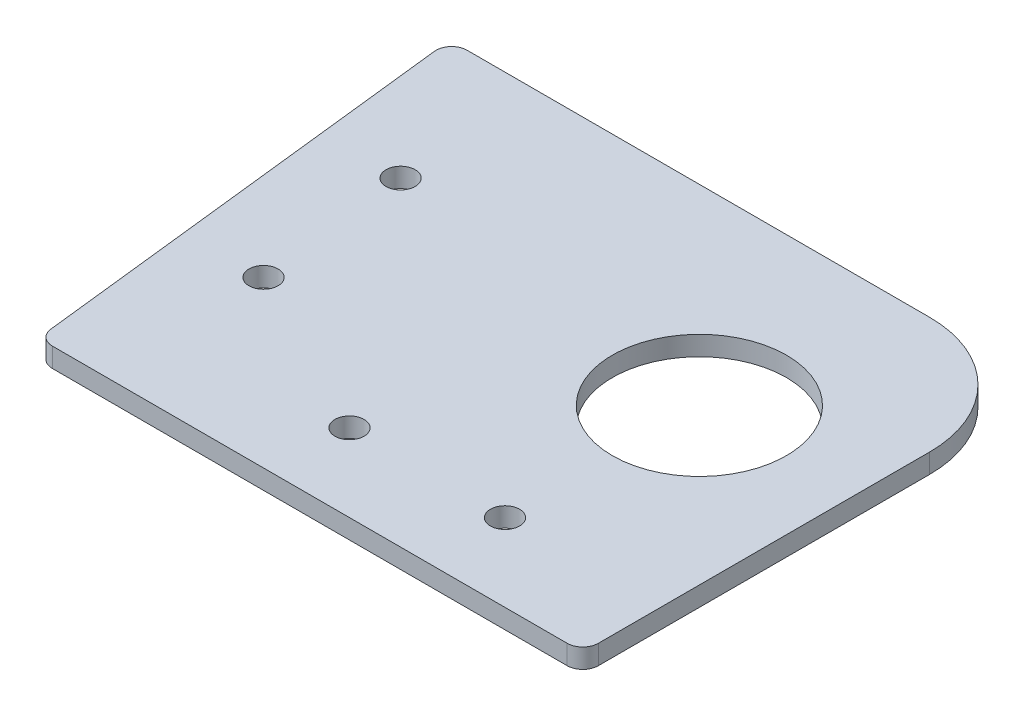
ISO-10303-21;
HEADER;
FILE_DESCRIPTION(('STEP AP214'),'2;1');
FILE_NAME('part.step','',(''),(''),'','','');
FILE_SCHEMA(('AUTOMOTIVE_DESIGN { 1 0 10303 214 1 1 1 1 }'));
ENDSEC;
DATA;
#1=APPLICATION_CONTEXT('core data for automotive mechanical design processes');
#2=APPLICATION_PROTOCOL_DEFINITION('international standard','automotive_design',2000,#1);
#3=PRODUCT_CONTEXT('',#1,'mechanical');
#4=PRODUCT('Part','Part','',(#3));
#5=PRODUCT_RELATED_PRODUCT_CATEGORY('part','',(#4));
#6=PRODUCT_DEFINITION_FORMATION('','',#4);
#7=PRODUCT_DEFINITION_CONTEXT('part definition',#1,'design');
#8=PRODUCT_DEFINITION('design','',#6,#7);
#9=PRODUCT_DEFINITION_SHAPE('','',#8);
#10=(LENGTH_UNIT() NAMED_UNIT(*) SI_UNIT(.MILLI.,.METRE.));
#11=(NAMED_UNIT(*) PLANE_ANGLE_UNIT() SI_UNIT($,.RADIAN.));
#12=(NAMED_UNIT(*) SI_UNIT($,.STERADIAN.) SOLID_ANGLE_UNIT());
#13=UNCERTAINTY_MEASURE_WITH_UNIT(LENGTH_MEASURE(1.E-05),#10,'distance_accuracy_value','');
#14=(GEOMETRIC_REPRESENTATION_CONTEXT(3) GLOBAL_UNCERTAINTY_ASSIGNED_CONTEXT((#13)) GLOBAL_UNIT_ASSIGNED_CONTEXT((#10,
#11,#12)) REPRESENTATION_CONTEXT('',''));
#15=CARTESIAN_POINT('',(0.,0.,0.));
#16=DIRECTION('',(0.,0.,1.));
#17=DIRECTION('',(1.,0.,0.));
#18=AXIS2_PLACEMENT_3D('',#15,#16,#17);
#19=CARTESIAN_POINT('',(0.,3.175,0.));
#20=DIRECTION('',(0.,-1.,0.));
#21=DIRECTION('',(0.,0.,-1.));
#22=AXIS2_PLACEMENT_3D('',#19,#20,#21);
#23=PLANE('',#22);
#24=CARTESIAN_POINT('',(15.4895049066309,3.175,23.519027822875));
#25=DIRECTION('',(0.,1.,0.));
#26=DIRECTION('',(0.,0.,1.));
#27=AXIS2_PLACEMENT_3D('',#24,#25,#26);
#28=CIRCLE('',#27,2.38125000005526);
#29=CARTESIAN_POINT('',(15.4895049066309,3.175,25.9002778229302));
#30=VERTEX_POINT('',#29);
#31=EDGE_CURVE('E197',#30,#30,#28,.T.);
#32=ORIENTED_EDGE('',*,*,#31,.F.);
#33=EDGE_LOOP('',(#32));
#34=FACE_BOUND('',#33,.T.);
#35=CARTESIAN_POINT('',(18.3391419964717,3.175,48.7586706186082));
#36=DIRECTION('',(0.,1.,0.));
#37=DIRECTION('',(0.,0.,1.));
#38=AXIS2_PLACEMENT_3D('',#35,#36,#37);
#39=CIRCLE('',#38,2.38125000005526);
#40=CARTESIAN_POINT('',(18.3391419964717,3.175,51.1399206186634));
#41=VERTEX_POINT('',#40);
#42=EDGE_CURVE('E191',#41,#41,#39,.T.);
#43=ORIENTED_EDGE('',*,*,#42,.F.);
#44=EDGE_LOOP('',(#43));
#45=FACE_BOUND('',#44,.T.);
#46=CARTESIAN_POINT('',(72.0467966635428,3.175,63.0191671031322));
#47=DIRECTION('',(0.,1.,0.));
#48=DIRECTION('',(0.,0.,1.));
#49=AXIS2_PLACEMENT_3D('',#46,#47,#48);
#50=CIRCLE('',#49,2.38125);
#51=CARTESIAN_POINT('',(72.0467966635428,3.175,65.4004171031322));
#52=VERTEX_POINT('',#51);
#53=EDGE_CURVE('E185',#52,#52,#50,.T.);
#54=ORIENTED_EDGE('',*,*,#53,.F.);
#55=EDGE_LOOP('',(#54));
#56=FACE_BOUND('',#55,.T.);
#57=CARTESIAN_POINT('',(46.6467966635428,3.175,63.0191671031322));
#58=DIRECTION('',(0.,1.,0.));
#59=DIRECTION('',(0.,0.,1.));
#60=AXIS2_PLACEMENT_3D('',#57,#58,#59);
#61=CIRCLE('',#60,2.38125);
#62=CARTESIAN_POINT('',(46.6467966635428,3.175,65.4004171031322));
#63=VERTEX_POINT('',#62);
#64=EDGE_CURVE('E179',#63,#63,#61,.T.);
#65=ORIENTED_EDGE('',*,*,#64,.F.);
#66=EDGE_LOOP('',(#65));
#67=FACE_BOUND('',#66,.T.);
#68=DIRECTION('',(0.,0.,-1.));
#69=VECTOR('',#68,1.);
#70=CARTESIAN_POINT('',(97.4467966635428,3.175,0.));
#71=LINE('',#70,#69);
#72=CARTESIAN_POINT('',(97.4467966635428,3.175,73.1791671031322));
#73=VERTEX_POINT('',#72);
#74=CARTESIAN_POINT('',(97.4467966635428,3.175,19.05));
#75=VERTEX_POINT('',#74);
#76=EDGE_CURVE('E135',#73,#75,#71,.T.);
#77=ORIENTED_EDGE('',*,*,#76,.T.);
#78=CARTESIAN_POINT('',(78.3967966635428,3.175,19.05));
#79=DIRECTION('',(0.,-1.,0.));
#80=DIRECTION('',(0.,0.,-1.));
#81=AXIS2_PLACEMENT_3D('',#78,#79,#80);
#82=CIRCLE('',#81,19.05);
#83=CARTESIAN_POINT('',(78.3967966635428,3.175,0.));
#84=VERTEX_POINT('',#83);
#85=EDGE_CURVE('E11',#75,#84,#82,.F.);
#86=ORIENTED_EDGE('',*,*,#85,.T.);
#87=DIRECTION('',(-1.,0.,0.));
#88=VECTOR('',#87,1.);
#89=CARTESIAN_POINT('',(0.,3.175,0.));
#90=LINE('',#89,#88);
#91=CARTESIAN_POINT('',(2.84283189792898,3.175,0.));
#92=VERTEX_POINT('',#91);
#93=EDGE_CURVE('E134',#84,#92,#90,.T.);
#94=ORIENTED_EDGE('',*,*,#93,.T.);
#95=CARTESIAN_POINT('',(2.84283189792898,3.175,2.54));
#96=DIRECTION('',(0.,-1.,0.));
#97=DIRECTION('',(0.,0.,-1.));
#98=AXIS2_PLACEMENT_3D('',#95,#96,#97);
#99=CIRCLE('',#98,2.54);
#100=CARTESIAN_POINT('',(0.318859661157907,3.175,2.82489322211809));
#101=VERTEX_POINT('',#100);
#102=EDGE_CURVE('E144',#92,#101,#99,.F.);
#103=ORIENTED_EDGE('',*,*,#102,.T.);
#104=DIRECTION('',(0.112162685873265,0.,0.993689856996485));
#105=VECTOR('',#104,1.);
#106=CARTESIAN_POINT('',(0.,3.175,0.));
#107=LINE('',#106,#105);
#108=CARTESIAN_POINT('',(8.29225161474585,3.175,73.4640603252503));
#109=VERTEX_POINT('',#108);
#110=EDGE_CURVE('E116',#101,#109,#107,.T.);
#111=ORIENTED_EDGE('',*,*,#110,.T.);
#112=CARTESIAN_POINT('',(10.8162238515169,3.175,73.1791671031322));
#113=DIRECTION('',(0.,-1.,0.));
#114=DIRECTION('',(0.,0.,-1.));
#115=AXIS2_PLACEMENT_3D('',#112,#113,#114);
#116=CIRCLE('',#115,2.54);
#117=CARTESIAN_POINT('',(10.8162238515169,3.175,75.7191671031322));
#118=VERTEX_POINT('',#117);
#119=EDGE_CURVE('E140',#109,#118,#116,.F.);
#120=ORIENTED_EDGE('',*,*,#119,.T.);
#121=DIRECTION('',(1.,0.,0.));
#122=VECTOR('',#121,1.);
#123=CARTESIAN_POINT('',(8.54679666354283,3.175,75.7191671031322));
#124=LINE('',#123,#122);
#125=CARTESIAN_POINT('',(94.9067966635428,3.175,75.7191671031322));
#126=VERTEX_POINT('',#125);
#127=EDGE_CURVE('E168',#118,#126,#124,.T.);
#128=ORIENTED_EDGE('',*,*,#127,.T.);
#129=CARTESIAN_POINT('',(94.9067966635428,3.175,73.1791671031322));
#130=DIRECTION('',(0.,-1.,0.));
#131=DIRECTION('',(0.,0.,-1.));
#132=AXIS2_PLACEMENT_3D('',#129,#130,#131);
#133=CIRCLE('',#132,2.54);
#134=EDGE_CURVE('E142',#126,#73,#133,.F.);
#135=ORIENTED_EDGE('',*,*,#134,.T.);
#136=EDGE_LOOP('',(#77,#86,#94,#103,#111,#120,#128,#135));
#137=FACE_BOUND('',#136,.T.);
#138=CARTESIAN_POINT('',(72.0467966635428,3.175,31.2691671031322));
#139=DIRECTION('',(0.,1.,0.));
#140=DIRECTION('',(0.,0.,1.));
#141=AXIS2_PLACEMENT_3D('',#138,#139,#140);
#142=CIRCLE('',#141,14.224);
#143=CARTESIAN_POINT('',(72.0467966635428,3.175,45.4931671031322));
#144=VERTEX_POINT('',#143);
#145=EDGE_CURVE('E129',#144,#144,#142,.T.);
#146=ORIENTED_EDGE('',*,*,#145,.F.);
#147=EDGE_LOOP('',(#146));
#148=FACE_BOUND('',#147,.T.);
#149=ADVANCED_FACE('F33',(#34,#45,#56,#67,#137,#148),#23,.F.);
#150=CARTESIAN_POINT('',(0.,0.,0.));
#151=DIRECTION('',(0.,-1.,0.));
#152=DIRECTION('',(0.,0.,-1.));
#153=AXIS2_PLACEMENT_3D('',#150,#151,#152);
#154=PLANE('',#153);
#155=CARTESIAN_POINT('',(15.4895049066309,0.,23.519027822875));
#156=DIRECTION('',(0.,1.,0.));
#157=DIRECTION('',(0.,0.,1.));
#158=AXIS2_PLACEMENT_3D('',#155,#156,#157);
#159=CIRCLE('',#158,2.38125000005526);
#160=CARTESIAN_POINT('',(15.4895049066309,0.,25.9002778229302));
#161=VERTEX_POINT('',#160);
#162=EDGE_CURVE('E194',#161,#161,#159,.T.);
#163=ORIENTED_EDGE('',*,*,#162,.T.);
#164=EDGE_LOOP('',(#163));
#165=FACE_BOUND('',#164,.T.);
#166=CARTESIAN_POINT('',(18.3391419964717,0.,48.7586706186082));
#167=DIRECTION('',(0.,1.,0.));
#168=DIRECTION('',(0.,0.,1.));
#169=AXIS2_PLACEMENT_3D('',#166,#167,#168);
#170=CIRCLE('',#169,2.38125000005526);
#171=CARTESIAN_POINT('',(18.3391419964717,0.,51.1399206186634));
#172=VERTEX_POINT('',#171);
#173=EDGE_CURVE('E188',#172,#172,#170,.T.);
#174=ORIENTED_EDGE('',*,*,#173,.T.);
#175=EDGE_LOOP('',(#174));
#176=FACE_BOUND('',#175,.T.);
#177=CARTESIAN_POINT('',(72.0467966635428,0.,63.0191671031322));
#178=DIRECTION('',(0.,1.,0.));
#179=DIRECTION('',(0.,0.,1.));
#180=AXIS2_PLACEMENT_3D('',#177,#178,#179);
#181=CIRCLE('',#180,2.38125);
#182=CARTESIAN_POINT('',(72.0467966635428,0.,65.4004171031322));
#183=VERTEX_POINT('',#182);
#184=EDGE_CURVE('E182',#183,#183,#181,.T.);
#185=ORIENTED_EDGE('',*,*,#184,.T.);
#186=EDGE_LOOP('',(#185));
#187=FACE_BOUND('',#186,.T.);
#188=CARTESIAN_POINT('',(46.6467966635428,0.,63.0191671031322));
#189=DIRECTION('',(0.,1.,0.));
#190=DIRECTION('',(0.,0.,1.));
#191=AXIS2_PLACEMENT_3D('',#188,#189,#190);
#192=CIRCLE('',#191,2.38125);
#193=CARTESIAN_POINT('',(46.6467966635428,0.,65.4004171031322));
#194=VERTEX_POINT('',#193);
#195=EDGE_CURVE('E176',#194,#194,#192,.T.);
#196=ORIENTED_EDGE('',*,*,#195,.T.);
#197=EDGE_LOOP('',(#196));
#198=FACE_BOUND('',#197,.T.);
#199=DIRECTION('',(-1.,0.,0.));
#200=VECTOR('',#199,1.);
#201=CARTESIAN_POINT('',(0.,0.,0.));
#202=LINE('',#201,#200);
#203=CARTESIAN_POINT('',(78.3967966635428,0.,0.));
#204=VERTEX_POINT('',#203);
#205=CARTESIAN_POINT('',(2.84283189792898,0.,0.));
#206=VERTEX_POINT('',#205);
#207=EDGE_CURVE('E124',#204,#206,#202,.T.);
#208=ORIENTED_EDGE('',*,*,#207,.F.);
#209=CARTESIAN_POINT('',(78.3967966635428,0.,19.05));
#210=DIRECTION('',(0.,-1.,0.));
#211=DIRECTION('',(0.,0.,-1.));
#212=AXIS2_PLACEMENT_3D('',#209,#210,#211);
#213=CIRCLE('',#212,19.05);
#214=CARTESIAN_POINT('',(97.4467966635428,0.,19.05));
#215=VERTEX_POINT('',#214);
#216=EDGE_CURVE('E55',#204,#215,#213,.T.);
#217=ORIENTED_EDGE('',*,*,#216,.T.);
#218=DIRECTION('',(0.,0.,-1.));
#219=VECTOR('',#218,1.);
#220=CARTESIAN_POINT('',(97.4467966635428,0.,0.));
#221=LINE('',#220,#219);
#222=CARTESIAN_POINT('',(97.4467966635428,0.,73.1791671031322));
#223=VERTEX_POINT('',#222);
#224=EDGE_CURVE('E127',#223,#215,#221,.T.);
#225=ORIENTED_EDGE('',*,*,#224,.F.);
#226=CARTESIAN_POINT('',(94.9067966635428,0.,73.1791671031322));
#227=DIRECTION('',(0.,-1.,0.));
#228=DIRECTION('',(0.,0.,-1.));
#229=AXIS2_PLACEMENT_3D('',#226,#227,#228);
#230=CIRCLE('',#229,2.54);
#231=CARTESIAN_POINT('',(94.9067966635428,0.,75.7191671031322));
#232=VERTEX_POINT('',#231);
#233=EDGE_CURVE('E107',#223,#232,#230,.T.);
#234=ORIENTED_EDGE('',*,*,#233,.T.);
#235=DIRECTION('',(1.,0.,0.));
#236=VECTOR('',#235,1.);
#237=CARTESIAN_POINT('',(8.54679666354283,0.,75.7191671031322));
#238=LINE('',#237,#236);
#239=CARTESIAN_POINT('',(10.8162238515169,0.,75.7191671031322));
#240=VERTEX_POINT('',#239);
#241=EDGE_CURVE('E123',#240,#232,#238,.T.);
#242=ORIENTED_EDGE('',*,*,#241,.F.);
#243=CARTESIAN_POINT('',(10.8162238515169,0.,73.1791671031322));
#244=DIRECTION('',(0.,-1.,0.));
#245=DIRECTION('',(0.,0.,-1.));
#246=AXIS2_PLACEMENT_3D('',#243,#244,#245);
#247=CIRCLE('',#246,2.54);
#248=CARTESIAN_POINT('',(8.29225161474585,0.,73.4640603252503));
#249=VERTEX_POINT('',#248);
#250=EDGE_CURVE('E117',#240,#249,#247,.T.);
#251=ORIENTED_EDGE('',*,*,#250,.T.);
#252=DIRECTION('',(0.112162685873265,0.,0.993689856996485));
#253=VECTOR('',#252,1.);
#254=CARTESIAN_POINT('',(0.,0.,0.));
#255=LINE('',#254,#253);
#256=CARTESIAN_POINT('',(0.318859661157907,0.,2.82489322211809));
#257=VERTEX_POINT('',#256);
#258=EDGE_CURVE('E113',#257,#249,#255,.T.);
#259=ORIENTED_EDGE('',*,*,#258,.F.);
#260=CARTESIAN_POINT('',(2.84283189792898,0.,2.54));
#261=DIRECTION('',(0.,-1.,0.));
#262=DIRECTION('',(0.,0.,-1.));
#263=AXIS2_PLACEMENT_3D('',#260,#261,#262);
#264=CIRCLE('',#263,2.54);
#265=EDGE_CURVE('E99',#257,#206,#264,.T.);
#266=ORIENTED_EDGE('',*,*,#265,.T.);
#267=EDGE_LOOP('',(#208,#217,#225,#234,#242,#251,#259,#266));
#268=FACE_BOUND('',#267,.T.);
#269=CARTESIAN_POINT('',(72.0467966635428,0.,31.2691671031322));
#270=DIRECTION('',(0.,1.,0.));
#271=DIRECTION('',(0.,0.,1.));
#272=AXIS2_PLACEMENT_3D('',#269,#270,#271);
#273=CIRCLE('',#272,14.224);
#274=CARTESIAN_POINT('',(72.0467966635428,0.,45.4931671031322));
#275=VERTEX_POINT('',#274);
#276=EDGE_CURVE('E173',#275,#275,#273,.T.);
#277=ORIENTED_EDGE('',*,*,#276,.T.);
#278=EDGE_LOOP('',(#277));
#279=FACE_BOUND('',#278,.T.);
#280=ADVANCED_FACE('F120',(#165,#176,#187,#198,#268,#279),#154,.T.);
#281=CARTESIAN_POINT('',(0.,3.175,0.));
#282=DIRECTION('',(0.,0.,1.));
#283=DIRECTION('',(1.,0.,0.));
#284=AXIS2_PLACEMENT_3D('',#281,#282,#283);
#285=PLANE('',#284);
#286=ORIENTED_EDGE('',*,*,#93,.F.);
#287=DIRECTION('',(0.,-1.,0.));
#288=VECTOR('',#287,1.);
#289=CARTESIAN_POINT('',(78.3967966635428,3.175,0.));
#290=LINE('',#289,#288);
#291=EDGE_CURVE('E154',#84,#204,#290,.T.);
#292=ORIENTED_EDGE('',*,*,#291,.T.);
#293=ORIENTED_EDGE('',*,*,#207,.T.);
#294=DIRECTION('',(0.,-1.,0.));
#295=VECTOR('',#294,1.);
#296=CARTESIAN_POINT('',(2.84283189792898,3.175,0.));
#297=LINE('',#296,#295);
#298=EDGE_CURVE('E105',#206,#92,#297,.F.);
#299=ORIENTED_EDGE('',*,*,#298,.T.);
#300=EDGE_LOOP('',(#286,#292,#293,#299));
#301=FACE_BOUND('',#300,.T.);
#302=ADVANCED_FACE('F160',(#301),#285,.F.);
#303=CARTESIAN_POINT('',(0.,3.175,0.));
#304=DIRECTION('',(0.993689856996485,0.,-0.112162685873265));
#305=DIRECTION('',(-0.112162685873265,0.,-0.993689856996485));
#306=AXIS2_PLACEMENT_3D('',#303,#304,#305);
#307=PLANE('',#306);
#308=ORIENTED_EDGE('',*,*,#110,.F.);
#309=DIRECTION('',(0.,-1.,0.));
#310=VECTOR('',#309,1.);
#311=CARTESIAN_POINT('',(0.318859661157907,3.175,2.82489322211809));
#312=LINE('',#311,#310);
#313=EDGE_CURVE('E103',#101,#257,#312,.T.);
#314=ORIENTED_EDGE('',*,*,#313,.T.);
#315=ORIENTED_EDGE('',*,*,#258,.T.);
#316=DIRECTION('',(0.,-1.,0.));
#317=VECTOR('',#316,1.);
#318=CARTESIAN_POINT('',(8.29225161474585,3.175,73.4640603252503));
#319=LINE('',#318,#317);
#320=EDGE_CURVE('E118',#249,#109,#319,.F.);
#321=ORIENTED_EDGE('',*,*,#320,.T.);
#322=EDGE_LOOP('',(#308,#314,#315,#321));
#323=FACE_BOUND('',#322,.T.);
#324=ADVANCED_FACE('F112',(#323),#307,.F.);
#325=CARTESIAN_POINT('',(8.54679666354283,3.175,75.7191671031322));
#326=DIRECTION('',(0.,0.,-1.));
#327=DIRECTION('',(-1.,0.,0.));
#328=AXIS2_PLACEMENT_3D('',#325,#326,#327);
#329=PLANE('',#328);
#330=ORIENTED_EDGE('',*,*,#241,.T.);
#331=DIRECTION('',(0.,-1.,0.));
#332=VECTOR('',#331,1.);
#333=CARTESIAN_POINT('',(94.9067966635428,3.175,75.7191671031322));
#334=LINE('',#333,#332);
#335=EDGE_CURVE('E152',#232,#126,#334,.F.);
#336=ORIENTED_EDGE('',*,*,#335,.T.);
#337=ORIENTED_EDGE('',*,*,#127,.F.);
#338=DIRECTION('',(0.,-1.,0.));
#339=VECTOR('',#338,1.);
#340=CARTESIAN_POINT('',(10.8162238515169,3.175,75.7191671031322));
#341=LINE('',#340,#339);
#342=EDGE_CURVE('E149',#118,#240,#341,.T.);
#343=ORIENTED_EDGE('',*,*,#342,.T.);
#344=EDGE_LOOP('',(#330,#336,#337,#343));
#345=FACE_BOUND('',#344,.T.);
#346=ADVANCED_FACE('F245',(#345),#329,.F.);
#347=CARTESIAN_POINT('',(97.4467966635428,3.175,0.));
#348=DIRECTION('',(-1.,0.,0.));
#349=DIRECTION('',(0.,0.,1.));
#350=AXIS2_PLACEMENT_3D('',#347,#348,#349);
#351=PLANE('',#350);
#352=ORIENTED_EDGE('',*,*,#224,.T.);
#353=DIRECTION('',(0.,-1.,0.));
#354=VECTOR('',#353,1.);
#355=CARTESIAN_POINT('',(97.4467966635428,3.175,19.05));
#356=LINE('',#355,#354);
#357=EDGE_CURVE('E41',#215,#75,#356,.F.);
#358=ORIENTED_EDGE('',*,*,#357,.T.);
#359=ORIENTED_EDGE('',*,*,#76,.F.);
#360=DIRECTION('',(0.,-1.,0.));
#361=VECTOR('',#360,1.);
#362=CARTESIAN_POINT('',(97.4467966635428,3.175,73.1791671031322));
#363=LINE('',#362,#361);
#364=EDGE_CURVE('E146',#73,#223,#363,.T.);
#365=ORIENTED_EDGE('',*,*,#364,.T.);
#366=EDGE_LOOP('',(#352,#358,#359,#365));
#367=FACE_BOUND('',#366,.T.);
#368=ADVANCED_FACE('F238',(#367),#351,.F.);
#369=CARTESIAN_POINT('',(72.0467966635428,3.175,31.2691671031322));
#370=DIRECTION('',(0.,-1.,0.));
#371=DIRECTION('',(0.,0.,-1.));
#372=AXIS2_PLACEMENT_3D('',#369,#370,#371);
#373=CYLINDRICAL_SURFACE('',#372,14.224);
#374=ORIENTED_EDGE('',*,*,#145,.T.);
#375=EDGE_LOOP('',(#374));
#376=FACE_BOUND('',#375,.T.);
#377=ORIENTED_EDGE('',*,*,#276,.F.);
#378=EDGE_LOOP('',(#377));
#379=FACE_BOUND('',#378,.T.);
#380=ADVANCED_FACE('F236',(#376,#379),#373,.F.);
#381=CARTESIAN_POINT('',(2.84283189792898,3.175,2.54));
#382=DIRECTION('',(0.,-1.,0.));
#383=DIRECTION('',(0.,0.,-1.));
#384=AXIS2_PLACEMENT_3D('',#381,#382,#383);
#385=CYLINDRICAL_SURFACE('',#384,2.54);
#386=ORIENTED_EDGE('',*,*,#102,.F.);
#387=ORIENTED_EDGE('',*,*,#298,.F.);
#388=ORIENTED_EDGE('',*,*,#265,.F.);
#389=ORIENTED_EDGE('',*,*,#313,.F.);
#390=EDGE_LOOP('',(#386,#387,#388,#389));
#391=FACE_BOUND('',#390,.T.);
#392=ADVANCED_FACE('F102',(#391),#385,.T.);
#393=CARTESIAN_POINT('',(94.9067966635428,3.175,73.1791671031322));
#394=DIRECTION('',(0.,-1.,0.));
#395=DIRECTION('',(0.,0.,-1.));
#396=AXIS2_PLACEMENT_3D('',#393,#394,#395);
#397=CYLINDRICAL_SURFACE('',#396,2.54);
#398=ORIENTED_EDGE('',*,*,#134,.F.);
#399=ORIENTED_EDGE('',*,*,#335,.F.);
#400=ORIENTED_EDGE('',*,*,#233,.F.);
#401=ORIENTED_EDGE('',*,*,#364,.F.);
#402=EDGE_LOOP('',(#398,#399,#400,#401));
#403=FACE_BOUND('',#402,.T.);
#404=ADVANCED_FACE('F255',(#403),#397,.T.);
#405=CARTESIAN_POINT('',(10.8162238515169,3.175,73.1791671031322));
#406=DIRECTION('',(0.,-1.,0.));
#407=DIRECTION('',(0.,0.,-1.));
#408=AXIS2_PLACEMENT_3D('',#405,#406,#407);
#409=CYLINDRICAL_SURFACE('',#408,2.54);
#410=ORIENTED_EDGE('',*,*,#119,.F.);
#411=ORIENTED_EDGE('',*,*,#320,.F.);
#412=ORIENTED_EDGE('',*,*,#250,.F.);
#413=ORIENTED_EDGE('',*,*,#342,.F.);
#414=EDGE_LOOP('',(#410,#411,#412,#413));
#415=FACE_BOUND('',#414,.T.);
#416=ADVANCED_FACE('F232',(#415),#409,.T.);
#417=CARTESIAN_POINT('',(78.3967966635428,3.175,19.05));
#418=DIRECTION('',(0.,-1.,0.));
#419=DIRECTION('',(0.,0.,-1.));
#420=AXIS2_PLACEMENT_3D('',#417,#418,#419);
#421=CYLINDRICAL_SURFACE('',#420,19.05);
#422=ORIENTED_EDGE('',*,*,#85,.F.);
#423=ORIENTED_EDGE('',*,*,#357,.F.);
#424=ORIENTED_EDGE('',*,*,#216,.F.);
#425=ORIENTED_EDGE('',*,*,#291,.F.);
#426=EDGE_LOOP('',(#422,#423,#424,#425));
#427=FACE_BOUND('',#426,.T.);
#428=ADVANCED_FACE('F35',(#427),#421,.T.);
#429=CARTESIAN_POINT('',(46.6467966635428,0.,63.0191671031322));
#430=DIRECTION('',(0.,1.,0.));
#431=DIRECTION('',(0.,0.,1.));
#432=AXIS2_PLACEMENT_3D('',#429,#430,#431);
#433=CYLINDRICAL_SURFACE('',#432,2.38125);
#434=ORIENTED_EDGE('',*,*,#195,.F.);
#435=EDGE_LOOP('',(#434));
#436=FACE_BOUND('',#435,.T.);
#437=ORIENTED_EDGE('',*,*,#64,.T.);
#438=EDGE_LOOP('',(#437));
#439=FACE_BOUND('',#438,.T.);
#440=ADVANCED_FACE('F221',(#436,#439),#433,.F.);
#441=CARTESIAN_POINT('',(72.0467966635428,0.,63.0191671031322));
#442=DIRECTION('',(0.,1.,0.));
#443=DIRECTION('',(0.,0.,1.));
#444=AXIS2_PLACEMENT_3D('',#441,#442,#443);
#445=CYLINDRICAL_SURFACE('',#444,2.38125);
#446=ORIENTED_EDGE('',*,*,#184,.F.);
#447=EDGE_LOOP('',(#446));
#448=FACE_BOUND('',#447,.T.);
#449=ORIENTED_EDGE('',*,*,#53,.T.);
#450=EDGE_LOOP('',(#449));
#451=FACE_BOUND('',#450,.T.);
#452=ADVANCED_FACE('F223',(#448,#451),#445,.F.);
#453=CARTESIAN_POINT('',(18.3391419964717,0.,48.7586706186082));
#454=DIRECTION('',(0.,1.,0.));
#455=DIRECTION('',(0.,0.,1.));
#456=AXIS2_PLACEMENT_3D('',#453,#454,#455);
#457=CYLINDRICAL_SURFACE('',#456,2.38125000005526);
#458=ORIENTED_EDGE('',*,*,#173,.F.);
#459=EDGE_LOOP('',(#458));
#460=FACE_BOUND('',#459,.T.);
#461=ORIENTED_EDGE('',*,*,#42,.T.);
#462=EDGE_LOOP('',(#461));
#463=FACE_BOUND('',#462,.T.);
#464=ADVANCED_FACE('F208',(#460,#463),#457,.F.);
#465=CARTESIAN_POINT('',(15.4895049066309,0.,23.519027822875));
#466=DIRECTION('',(0.,1.,0.));
#467=DIRECTION('',(0.,0.,1.));
#468=AXIS2_PLACEMENT_3D('',#465,#466,#467);
#469=CYLINDRICAL_SURFACE('',#468,2.38125000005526);
#470=ORIENTED_EDGE('',*,*,#162,.F.);
#471=EDGE_LOOP('',(#470));
#472=FACE_BOUND('',#471,.T.);
#473=ORIENTED_EDGE('',*,*,#31,.T.);
#474=EDGE_LOOP('',(#473));
#475=FACE_BOUND('',#474,.T.);
#476=ADVANCED_FACE('F205',(#472,#475),#469,.F.);
#477=CLOSED_SHELL('',(#149,#280,#302,#324,#346,#368,#380,#392,#404,#416,#428,#440,#452,#464,#476));
#478=MANIFOLD_SOLID_BREP('B2',#477);
#479=ADVANCED_BREP_SHAPE_REPRESENTATION('',(#18,#478),#14);
#480=SHAPE_DEFINITION_REPRESENTATION(#9,#479);
ENDSEC;
END-ISO-10303-21;
